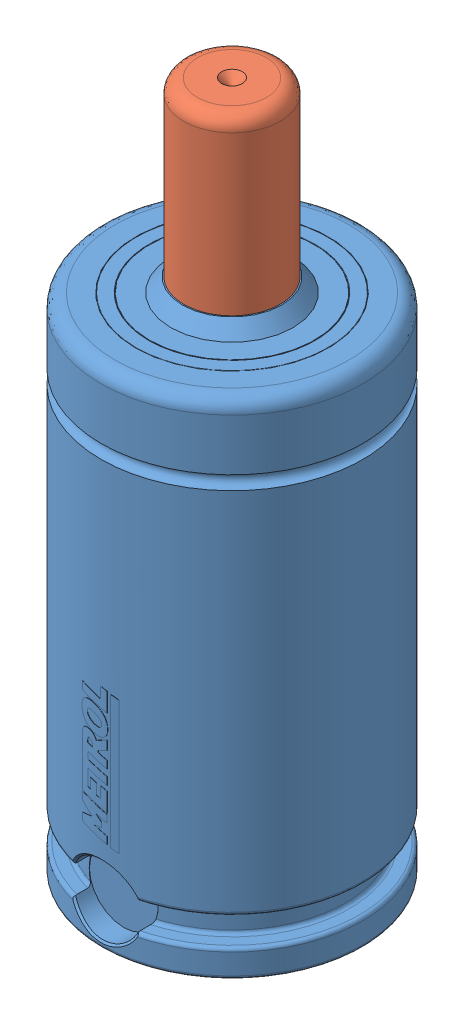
SolidWorks assembly ISNG0250-025.SLDASM, configuration Default (file format 7000). Lengths in mm.
Overall size (38 100 38.1).
2 component instances, 2 part files, 6 mates.
Components (placement in the parent):
- ISNG0250 BODY-1: ISNG0250 BODY.SLDPRT [ISNG0250-025] x (0 0 1) z (0 -1 0) size (38.1 38 75)
- ISNG0250 PISTON-1: ISNG0250 PISTON.SLDPRT [ISNG0250-025] at (0 50 0) x (-1 0 0) z (0 1 0) size (24 24 50)
Mates (geometry in assembly coordinates):
- Concentric1: concentric aligned: cylinder of ISNG0250 BODY-1 through (0 0 0) axis (0 -1 0) radius 7; cylinder of ISNG0250 PISTON-1 through (0 50 0) axis (0 -1 0) radius 7
- LimitDistance1: limit distance anti-aligned: plane of ISNG0250 BODY-1 through (-7 55 0) normal (0 -1 0); plane of ISNG0250 PISTON-1 through (0 55 12) normal (0 1 0)
- Coincident1: coincident anti-aligned: plane of ISNG0250 BODY-1 through (-19 0 0) normal (0 -1 0); plane of assembly through (0 0 0) normal (0 1 0)
- Coincident2: coincident aligned: plane of ISNG0250 BODY-1; plane of assembly through (0 0 0) normal (0 0 1)
- Coincident3: coincident anti-aligned: plane of ISNG0250 BODY-1; plane of assembly through (0 0 0) normal (1 0 0)
- Coincident4: coincident aligned: plane of ISNG0250 PISTON-1; plane of assembly through (0 0 0) normal (0 0 1)
